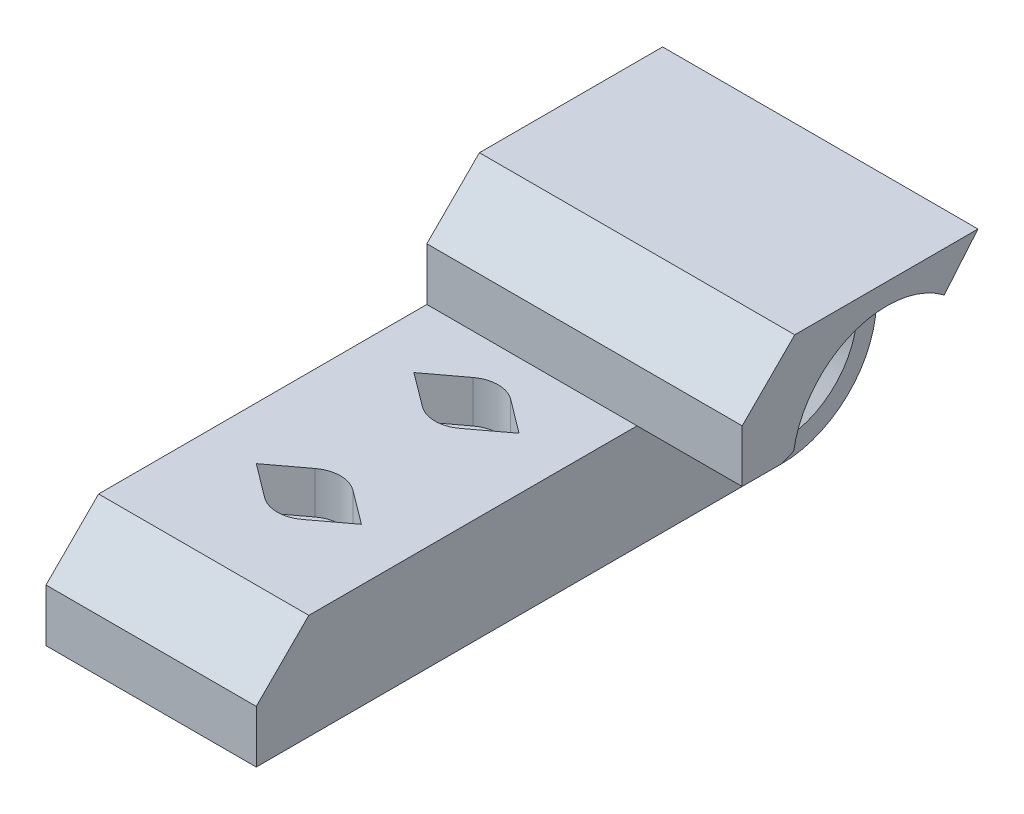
from build123d import *

# Parameters (mm, degrees)
BOSS_EXTRUDE1_DEPTH = 20
CUT_EXTRUDE1_REACH  = 65.095
SKETCH2_R           = 1.75
SKETCH3_R           = 3
CUT_EXTRUDE2_DEPTH  = 4
SKETCH5_R           = 6.15
CUT_EXTRUDE4_DEPTH  = 13
CHAMFER3_SIZE       = 1
BOSS_EXTRUDE3_START = -30
BOSS_EXTRUDE3_DEPTH = 30
CUT_EXTRUDE5_DEPTH  = 10
CUT_EXTRUDE7_DEPTH  = 4
CHAMFER5_SIZE       = 5


with BuildPart() as part:
    # Sketch1 → Boss-Extrude1 (new body)
    with BuildSketch(Plane(origin=(0, 0, 0), x_dir=(0, 0, -1), z_dir=(1, 0, 0))):
        with BuildLine():
            Line((0, 0), (50, 0))
            ThreePointArc((50, 0), (55.61248608, 16.03562364), (41.225035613, 7))
            Line((41.225035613, 7), (40, 10))
            Line((40, 10), (5, 10))
            Line((5, 10), (0, 5))
            Line((0, 5), (0, 0))
        make_face()
    extrude(amount=-BOSS_EXTRUDE1_DEPTH)

    # Sketch2 → Cut-Extrude1 (cut, up to next)
    with BuildSketch(Plane(origin=(0, 10, 0), x_dir=(1, 0, 0), z_dir=(0, 1, 0)), mode=Mode.PRIVATE) as cut_extrude1_sk1:
        with Locations(Location((-10, 30, 0), (0, 0, 270))):
            Circle(SKETCH2_R)
    cut_extrude1_tool1 = extrude(cut_extrude1_sk1.sketch, amount=-CUT_EXTRUDE1_REACH, mode=Mode.PRIVATE) & part.part
    # Sketch2 → Cut-Extrude1 (cut, up to next)
    with BuildSketch(Plane(origin=(0, 10, 0), x_dir=(1, 0, 0), z_dir=(0, 1, 0)), mode=Mode.PRIVATE) as cut_extrude1_sk2:
        with Locations(Location((-10, 15, 0), (0, 0, 270))):
            Circle(SKETCH2_R)
    cut_extrude1_tool2 = extrude(cut_extrude1_sk2.sketch, amount=-CUT_EXTRUDE1_REACH, mode=Mode.PRIVATE) & part.part
    add(cut_extrude1_tool1.solids().sort_by_distance((-10, 10, -30))[0], mode=Mode.SUBTRACT)
    add(cut_extrude1_tool2.solids().sort_by_distance((-10, 10, -15))[0], mode=Mode.SUBTRACT)

    # Sketch3 → Cut-Extrude2 (cut)
    with BuildSketch(Plane(origin=(0, 10, 0), x_dir=(1, 0, 0), z_dir=(0, 1, 0))):
        with Locations(Location((-10, 30, 0), (0, 0, 270))):
            Circle(SKETCH3_R)
        with Locations(Location((-10, 15, 0), (0, 0, 270))):
            Circle(SKETCH3_R)
    extrude(amount=-CUT_EXTRUDE2_DEPTH, mode=Mode.SUBTRACT)

    # Sketch5 → Cut-Extrude4 (cut)
    with BuildSketch(Plane(origin=(0, 0, 0), x_dir=(0, 0, -1), z_dir=(1, 0, 0))):
        with Locations((50, 9)):
            Circle(SKETCH5_R)
    extrude(amount=-CUT_EXTRUDE4_DEPTH, mode=Mode.SUBTRACT)

    # Chamfer3
    chamfer3_edges = [part.edges().sort_by_distance(p)[0] for p in [
        (0, 9, -43.85),
    ]]
    chamfer(chamfer3_edges, length=CHAMFER3_SIZE)

    # Sketch7 → Boss-Extrude3 (add)
    with BuildSketch(Plane.ZY.offset(20).offset(BOSS_EXTRUDE3_START)):
        with BuildLine():
            Line((-40, 10), (-36.225035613, 10))
            Line((-36.225035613, 10), (-36.225035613, 20))
            Line((-36.225035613, 20), (-58.654001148, 20))
            Line((-58.654001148, 20), (-55.440063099, 16.169777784))
            ThreePointArc((-55.440063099, 16.169777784), (-45.121311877, 16.562962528), (-41.225035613, 7))
            Line((-41.225035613, 7), (-40, 10))
        make_face()
    extrude(amount=BOSS_EXTRUDE3_DEPTH)

    # Sketch8 → Cut-Extrude5 (cut)
    with BuildSketch(Plane(origin=(10, 0, 0), x_dir=(0, 0, -1), z_dir=(1, 0, 0))):
        with BuildLine():
            Line((41.225035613, 7), (40, 10))
            Line((40, 10), (41.118688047, 10.456810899))
            ThreePointArc((41.118688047, 10.456810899), (41.004256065, 8.723249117), (41.225035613, 7))
        make_face()
    extrude(amount=-CUT_EXTRUDE5_DEPTH, mode=Mode.SUBTRACT)

    # Sketch10 → Cut-Extrude7 (cut)
    with BuildSketch(Plane(origin=(0, 10, 0), x_dir=(1, 0, 0), z_dir=(0, 1, 0))):
        with BuildLine():
            Line((-15, 30), (-11.8, 32.4))
            ThreePointArc((-11.8, 32.4), (-10, 33), (-8.2, 32.4))
            Line((-8.2, 32.4), (-5, 30))
            Line((-5, 30), (-8.2, 27.6))
            ThreePointArc((-8.2, 27.6), (-10, 27), (-11.8, 27.6))
            Line((-11.8, 27.6), (-15, 30))
        make_face()
        with BuildLine():
            Line((-5, 15), (-8.2, 17.4))
            ThreePointArc((-8.2, 17.4), (-10, 18), (-11.8, 17.4))
            Line((-11.8, 17.4), (-15, 15))
            Line((-15, 15), (-11.8, 12.6))
            ThreePointArc((-11.8, 12.6), (-10, 12), (-8.2, 12.6))
            Line((-8.2, 12.6), (-5, 15))
        make_face()
    extrude(amount=-CUT_EXTRUDE7_DEPTH, mode=Mode.SUBTRACT)

    # Chamfer5
    chamfer5_edges = [part.edges().sort_by_distance(p)[0] for p in [
        (-5, 20, -36.225035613),
    ]]
    chamfer(chamfer5_edges, length=CHAMFER5_SIZE)


solid = part.part
